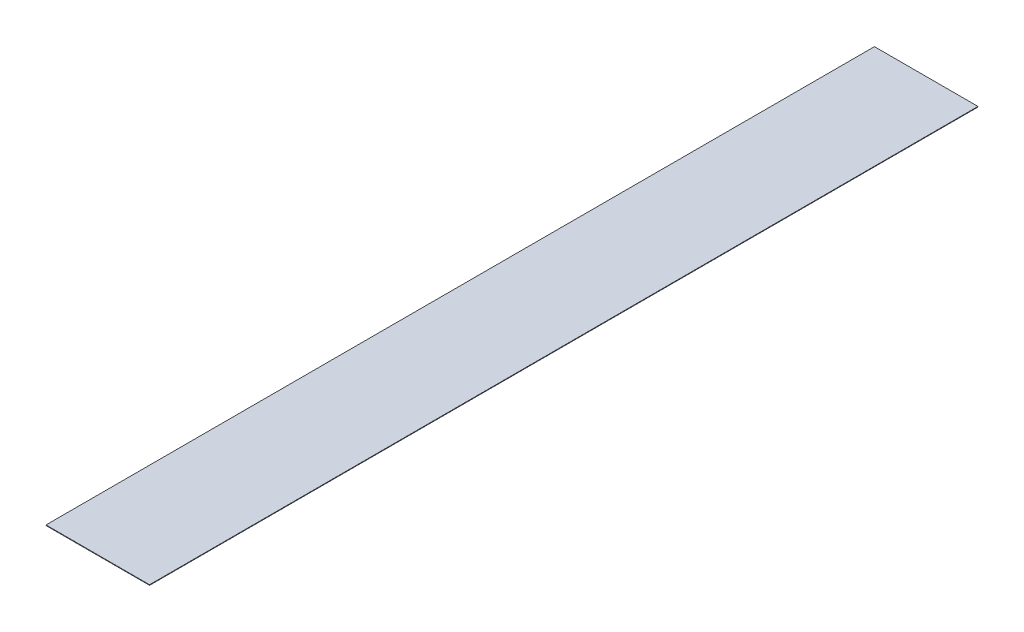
ISO-10303-21;
HEADER;
FILE_DESCRIPTION(('STEP AP214'),'2;1');
FILE_NAME('part.step','',(''),(''),'','','');
FILE_SCHEMA(('AUTOMOTIVE_DESIGN { 1 0 10303 214 1 1 1 1 }'));
ENDSEC;
DATA;
#1=APPLICATION_CONTEXT('core data for automotive mechanical design processes');
#2=APPLICATION_PROTOCOL_DEFINITION('international standard','automotive_design',2000,#1);
#3=PRODUCT_CONTEXT('',#1,'mechanical');
#4=PRODUCT('Part','Part','',(#3));
#5=PRODUCT_RELATED_PRODUCT_CATEGORY('part','',(#4));
#6=PRODUCT_DEFINITION_FORMATION('','',#4);
#7=PRODUCT_DEFINITION_CONTEXT('part definition',#1,'design');
#8=PRODUCT_DEFINITION('design','',#6,#7);
#9=PRODUCT_DEFINITION_SHAPE('','',#8);
#10=(LENGTH_UNIT() NAMED_UNIT(*) SI_UNIT(.MILLI.,.METRE.));
#11=(NAMED_UNIT(*) PLANE_ANGLE_UNIT() SI_UNIT($,.RADIAN.));
#12=(NAMED_UNIT(*) SI_UNIT($,.STERADIAN.) SOLID_ANGLE_UNIT());
#13=UNCERTAINTY_MEASURE_WITH_UNIT(LENGTH_MEASURE(1.E-05),#10,'distance_accuracy_value','');
#14=(GEOMETRIC_REPRESENTATION_CONTEXT(3) GLOBAL_UNCERTAINTY_ASSIGNED_CONTEXT((#13)) GLOBAL_UNIT_ASSIGNED_CONTEXT((#10,
#11,#12)) REPRESENTATION_CONTEXT('',''));
#15=CARTESIAN_POINT('',(0.,0.,0.));
#16=DIRECTION('',(0.,0.,1.));
#17=DIRECTION('',(1.,0.,0.));
#18=AXIS2_PLACEMENT_3D('',#15,#16,#17);
#19=CARTESIAN_POINT('',(0.,0.254,0.));
#20=DIRECTION('',(-1.,0.,0.));
#21=DIRECTION('',(0.,0.,1.));
#22=AXIS2_PLACEMENT_3D('',#19,#20,#21);
#23=PLANE('',#22);
#24=DIRECTION('',(0.,0.,-1.));
#25=VECTOR('',#24,1.);
#26=CARTESIAN_POINT('',(0.,0.,0.));
#27=LINE('',#26,#25);
#28=CARTESIAN_POINT('',(0.,0.,381.));
#29=VERTEX_POINT('',#28);
#30=CARTESIAN_POINT('',(0.,0.,0.));
#31=VERTEX_POINT('',#30);
#32=EDGE_CURVE('E96',#29,#31,#27,.T.);
#33=ORIENTED_EDGE('',*,*,#32,.T.);
#34=DIRECTION('',(0.,-1.,0.));
#35=VECTOR('',#34,1.);
#36=CARTESIAN_POINT('',(0.,0.254,0.));
#37=LINE('',#36,#35);
#38=CARTESIAN_POINT('',(0.,0.254,0.));
#39=VERTEX_POINT('',#38);
#40=EDGE_CURVE('E11',#39,#31,#37,.T.);
#41=ORIENTED_EDGE('',*,*,#40,.F.);
#42=DIRECTION('',(0.,0.,-1.));
#43=VECTOR('',#42,1.);
#44=CARTESIAN_POINT('',(0.,0.254,0.));
#45=LINE('',#44,#43);
#46=CARTESIAN_POINT('',(0.,0.254,381.));
#47=VERTEX_POINT('',#46);
#48=EDGE_CURVE('E84',#47,#39,#45,.T.);
#49=ORIENTED_EDGE('',*,*,#48,.F.);
#50=DIRECTION('',(0.,-1.,0.));
#51=VECTOR('',#50,1.);
#52=CARTESIAN_POINT('',(0.,0.254,381.));
#53=LINE('',#52,#51);
#54=EDGE_CURVE('E92',#47,#29,#53,.T.);
#55=ORIENTED_EDGE('',*,*,#54,.T.);
#56=EDGE_LOOP('',(#33,#41,#49,#55));
#57=FACE_BOUND('',#56,.T.);
#58=ADVANCED_FACE('F33',(#57),#23,.F.);
#59=CARTESIAN_POINT('',(-47.625,0.254,0.));
#60=DIRECTION('',(0.,0.,1.));
#61=DIRECTION('',(1.,0.,0.));
#62=AXIS2_PLACEMENT_3D('',#59,#60,#61);
#63=PLANE('',#62);
#64=DIRECTION('',(-1.,0.,0.));
#65=VECTOR('',#64,1.);
#66=CARTESIAN_POINT('',(-47.625,0.,0.));
#67=LINE('',#66,#65);
#68=CARTESIAN_POINT('',(-47.625,0.,0.));
#69=VERTEX_POINT('',#68);
#70=EDGE_CURVE('E88',#31,#69,#67,.T.);
#71=ORIENTED_EDGE('',*,*,#70,.T.);
#72=DIRECTION('',(0.,-1.,0.));
#73=VECTOR('',#72,1.);
#74=CARTESIAN_POINT('',(-47.625,0.254,0.));
#75=LINE('',#74,#73);
#76=CARTESIAN_POINT('',(-47.625,0.254,0.));
#77=VERTEX_POINT('',#76);
#78=EDGE_CURVE('E41',#77,#69,#75,.T.);
#79=ORIENTED_EDGE('',*,*,#78,.F.);
#80=DIRECTION('',(-1.,0.,0.));
#81=VECTOR('',#80,1.);
#82=CARTESIAN_POINT('',(-47.625,0.254,0.));
#83=LINE('',#82,#81);
#84=EDGE_CURVE('E79',#39,#77,#83,.T.);
#85=ORIENTED_EDGE('',*,*,#84,.F.);
#86=ORIENTED_EDGE('',*,*,#40,.T.);
#87=EDGE_LOOP('',(#71,#79,#85,#86));
#88=FACE_BOUND('',#87,.T.);
#89=ADVANCED_FACE('F87',(#88),#63,.F.);
#90=CARTESIAN_POINT('',(-47.625,0.254,0.));
#91=DIRECTION('',(1.,0.,0.));
#92=DIRECTION('',(0.,0.,-1.));
#93=AXIS2_PLACEMENT_3D('',#90,#91,#92);
#94=PLANE('',#93);
#95=DIRECTION('',(0.,0.,1.));
#96=VECTOR('',#95,1.);
#97=CARTESIAN_POINT('',(-47.625,0.,0.));
#98=LINE('',#97,#96);
#99=CARTESIAN_POINT('',(-47.625,0.,381.));
#100=VERTEX_POINT('',#99);
#101=EDGE_CURVE('E66',#69,#100,#98,.T.);
#102=ORIENTED_EDGE('',*,*,#101,.T.);
#103=DIRECTION('',(0.,-1.,0.));
#104=VECTOR('',#103,1.);
#105=CARTESIAN_POINT('',(-47.625,0.254,381.));
#106=LINE('',#105,#104);
#107=CARTESIAN_POINT('',(-47.625,0.254,381.));
#108=VERTEX_POINT('',#107);
#109=EDGE_CURVE('E89',#108,#100,#106,.T.);
#110=ORIENTED_EDGE('',*,*,#109,.F.);
#111=DIRECTION('',(0.,0.,1.));
#112=VECTOR('',#111,1.);
#113=CARTESIAN_POINT('',(-47.625,0.254,0.));
#114=LINE('',#113,#112);
#115=EDGE_CURVE('E82',#77,#108,#114,.T.);
#116=ORIENTED_EDGE('',*,*,#115,.F.);
#117=ORIENTED_EDGE('',*,*,#78,.T.);
#118=EDGE_LOOP('',(#102,#110,#116,#117));
#119=FACE_BOUND('',#118,.T.);
#120=ADVANCED_FACE('F90',(#119),#94,.F.);
#121=CARTESIAN_POINT('',(0.,0.254,381.));
#122=DIRECTION('',(0.,0.,-1.));
#123=DIRECTION('',(-1.,0.,0.));
#124=AXIS2_PLACEMENT_3D('',#121,#122,#123);
#125=PLANE('',#124);
#126=DIRECTION('',(1.,0.,0.));
#127=VECTOR('',#126,1.);
#128=CARTESIAN_POINT('',(0.,0.,381.));
#129=LINE('',#128,#127);
#130=EDGE_CURVE('E72',#100,#29,#129,.T.);
#131=ORIENTED_EDGE('',*,*,#130,.T.);
#132=ORIENTED_EDGE('',*,*,#54,.F.);
#133=DIRECTION('',(1.,0.,0.));
#134=VECTOR('',#133,1.);
#135=CARTESIAN_POINT('',(0.,0.254,381.));
#136=LINE('',#135,#134);
#137=EDGE_CURVE('E49',#108,#47,#136,.T.);
#138=ORIENTED_EDGE('',*,*,#137,.F.);
#139=ORIENTED_EDGE('',*,*,#109,.T.);
#140=EDGE_LOOP('',(#131,#132,#138,#139));
#141=FACE_BOUND('',#140,.T.);
#142=ADVANCED_FACE('F103',(#141),#125,.F.);
#143=CARTESIAN_POINT('',(0.,0.254,381.));
#144=DIRECTION('',(0.,-1.,0.));
#145=DIRECTION('',(0.,0.,-1.));
#146=AXIS2_PLACEMENT_3D('',#143,#144,#145);
#147=PLANE('',#146);
#148=ORIENTED_EDGE('',*,*,#48,.T.);
#149=ORIENTED_EDGE('',*,*,#84,.T.);
#150=ORIENTED_EDGE('',*,*,#115,.T.);
#151=ORIENTED_EDGE('',*,*,#137,.T.);
#152=EDGE_LOOP('',(#148,#149,#150,#151));
#153=FACE_BOUND('',#152,.T.);
#154=ADVANCED_FACE('F80',(#153),#147,.F.);
#155=CARTESIAN_POINT('',(0.,0.,381.));
#156=DIRECTION('',(0.,-1.,0.));
#157=DIRECTION('',(0.,0.,-1.));
#158=AXIS2_PLACEMENT_3D('',#155,#156,#157);
#159=PLANE('',#158);
#160=ORIENTED_EDGE('',*,*,#32,.F.);
#161=ORIENTED_EDGE('',*,*,#130,.F.);
#162=ORIENTED_EDGE('',*,*,#101,.F.);
#163=ORIENTED_EDGE('',*,*,#70,.F.);
#164=EDGE_LOOP('',(#160,#161,#162,#163));
#165=FACE_BOUND('',#164,.T.);
#166=ADVANCED_FACE('F106',(#165),#159,.T.);
#167=CLOSED_SHELL('',(#58,#89,#120,#142,#154,#166));
#168=MANIFOLD_SOLID_BREP('B2',#167);
#169=ADVANCED_BREP_SHAPE_REPRESENTATION('',(#18,#168),#14);
#170=SHAPE_DEFINITION_REPRESENTATION(#9,#169);
ENDSEC;
END-ISO-10303-21;
